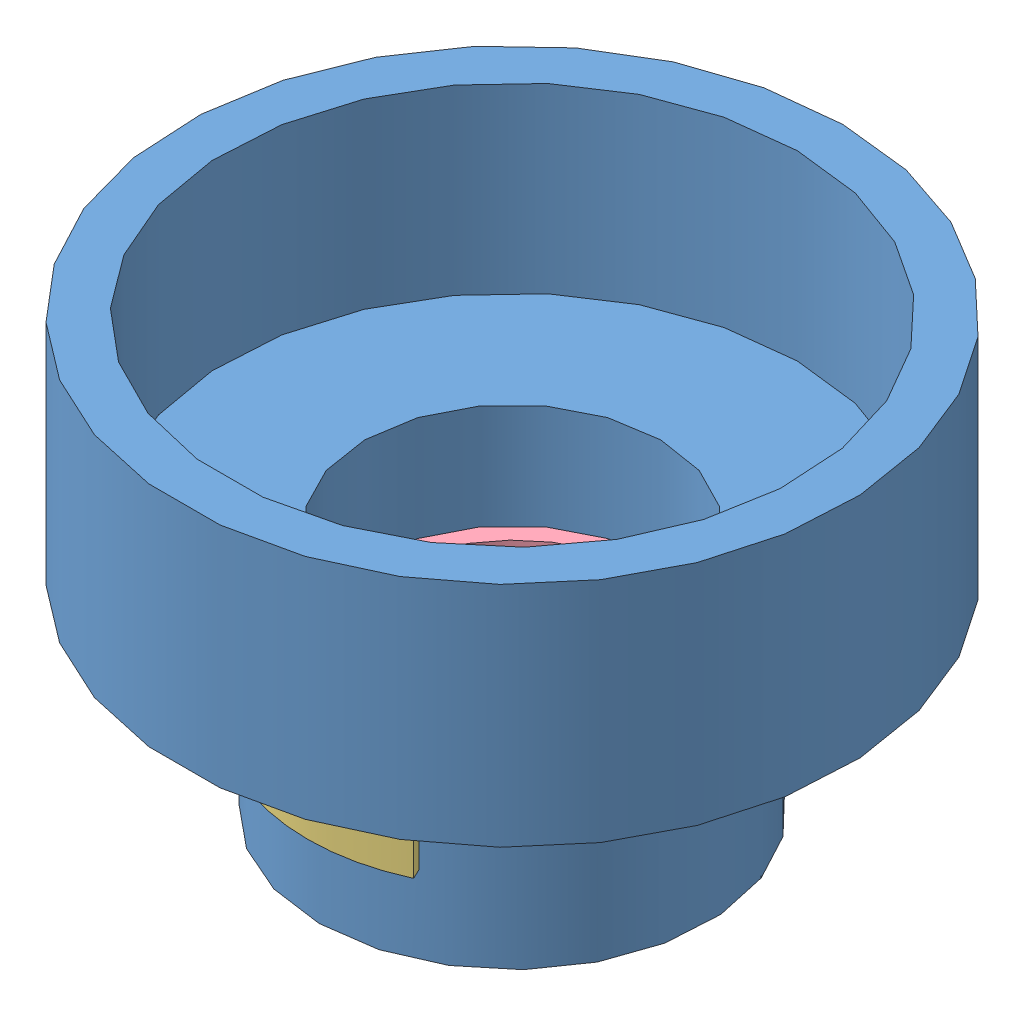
SolidWorks assembly Assemblage cage frein.SLDASM, configuration Défaut (file format 3400). Lengths in mm.
Overall size (145 94.5 145).
4 component instances, 4 part files, 8 mates.
Components (placement in the parent):
- Cage Frein-1: Cage Frein.SLDPRT [Défaut] at origin size (145 94.5 145)
- Clavette frein 44-1: Clavette frein 44.SLDPRT [Défaut] at (5 25.1827 -47.5) x (0 0 1) z (0 -1 0) size (10 10 44)
- Clavette frein circulaire-1: Clavette frein circulaire.SLDPRT [Défaut] at (0 7.9327 0) x (1 0 0) z (0 -1 0) size (38.04 8.75 10)
- Circlips ext 68mm-1: Circlips ext 68mm.SLDPRT [JIS B 2804 Hole use 65] at (0 12.1827 0) x (0.515162 0 -0.857093) z (0 1 0) size (68 67 2.5)
Mates (geometry in assembly coordinates):
- Coïncidente1: coincident anti-aligned: plane of Cage Frein-1 through (-5 36.363 -37.5) normal (0 0 -1); plane of Clavette frein 44-1 through (5 -18.8173 -37.5) normal (0 0 1)
- Coïncidente2: coincident anti-aligned: plane of Cage Frein-1 through (5 36.363 -42.5) normal (-1 0 0); plane of Clavette frein 44-1 through (5 -18.8173 -47.5) normal (1 0 0)
- Coïncidente3: coincident anti-aligned: plane of Cage Frein-1 through (72.5 25.1827 0) normal (0 -1 0); plane of Clavette frein 44-1 through (-5 25.1827 -47.5) normal (0 1 0)
- Coaxiale1: concentric aligned: cylinder of Cage Frein-1; cylinder of Clavette frein circulaire-1
- Coïncidente4: coincident anti-aligned: plane of Cage Frein-1 through (0 7.9327 0) normal (0 -1 0); plane of Clavette frein circulaire-1 through (0 7.9327 0) normal (0 1 0)
- Coïncidente5: coincident anti-aligned: plane of Cage Frein-1 through (-17.9613 -2.0673 38.5181) normal (0.906308 0 0.422618); plane of Clavette frein circulaire-1 through (-19.0178 -2.0673 40.7839) normal (-0.906308 0 -0.422618)
- Coaxiale21: concentric anti-aligned: unknown of Cage Frein-1
- Coïncidente61: coincident anti-aligned: unknown of Cage Frein-1
